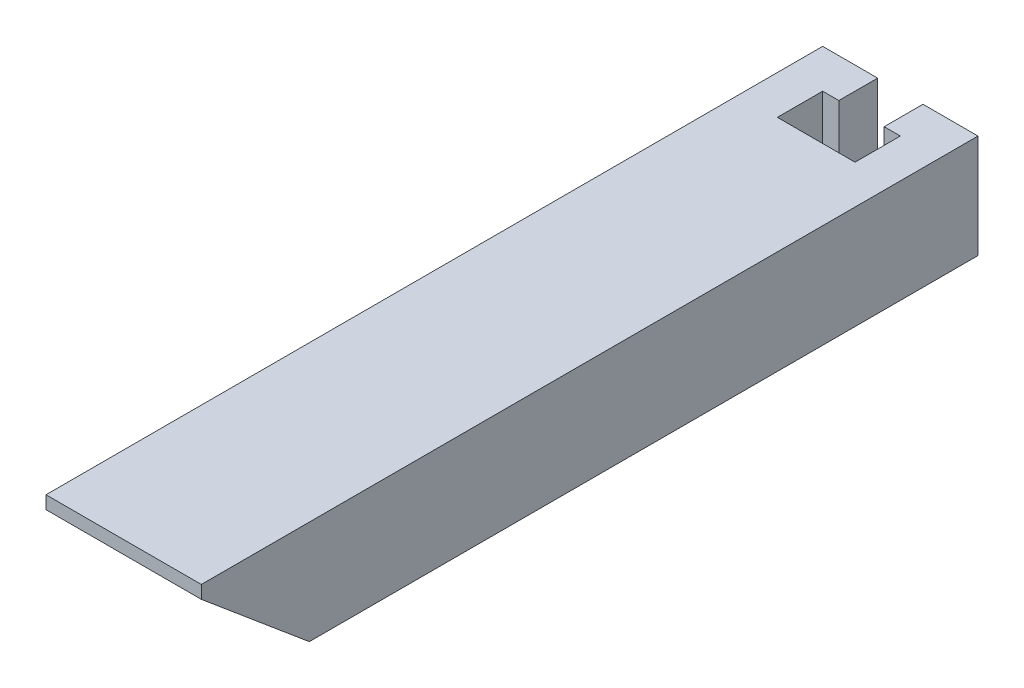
from build123d import *

# Parameters (mm, degrees)
SKETCH_1_W          = 12
SKETCH_1_H          = 8
EXTRUDE_1_DEPTH     = 60
SKETCH_2_OUTSIDE_W  = 74.342
SKETCH_2_OUTSIDE_H  = 22.342
CUT_EXTRUDE_1_DEPTH = 60
SKETCH_3_OUTSIDE_W  = 26.342
SKETCH_3_OUTSIDE_H  = 74.342
CUT_EXTRUDE_2_DEPTH = 60


with BuildPart() as part:
    # Sketch 1 → Extrude 1 (new body)
    with BuildSketch(Plane.XY):
        with Locations((6, 4)):
            Rectangle(SKETCH_1_W, SKETCH_1_H)
    extrude(amount=EXTRUDE_1_DEPTH)

    # Sketch 2 outside → Cut-Extrude 1 (cut)
    with BuildSketch(Plane(origin=(12, 0, 0), x_dir=(0, 0, -1), z_dir=(1, 0, 0))):
        with Locations((-30, 4)):
            Rectangle(SKETCH_2_OUTSIDE_W, SKETCH_2_OUTSIDE_H)
        Polygon((-51.657724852, 0), (0, 0), (0, 8), (-60, 8), (-60, 7), align=None, mode=Mode.SUBTRACT)
    extrude(amount=-CUT_EXTRUDE_1_DEPTH, mode=Mode.SUBTRACT)

    # Sketch 3 outside → Cut-Extrude 2 (cut)
    with BuildSketch(Plane(origin=(0, 8, 0), x_dir=(1, 0, 0), z_dir=(0, 1, 0))):
        with Locations((6, -30)):
            Rectangle(SKETCH_3_OUTSIDE_W, SKETCH_3_OUTSIDE_H)
        Polygon((0, -60), (12, -60), (12, 0), (7.75, 0), (7.75, -3), (9, -3), (9, -6.5), (3, -6.5), (3, -3), (4.25, -3), (4.25, 0), (0, 0), align=None, mode=Mode.SUBTRACT)
    extrude(amount=-CUT_EXTRUDE_2_DEPTH, mode=Mode.SUBTRACT)


solid = part.part
